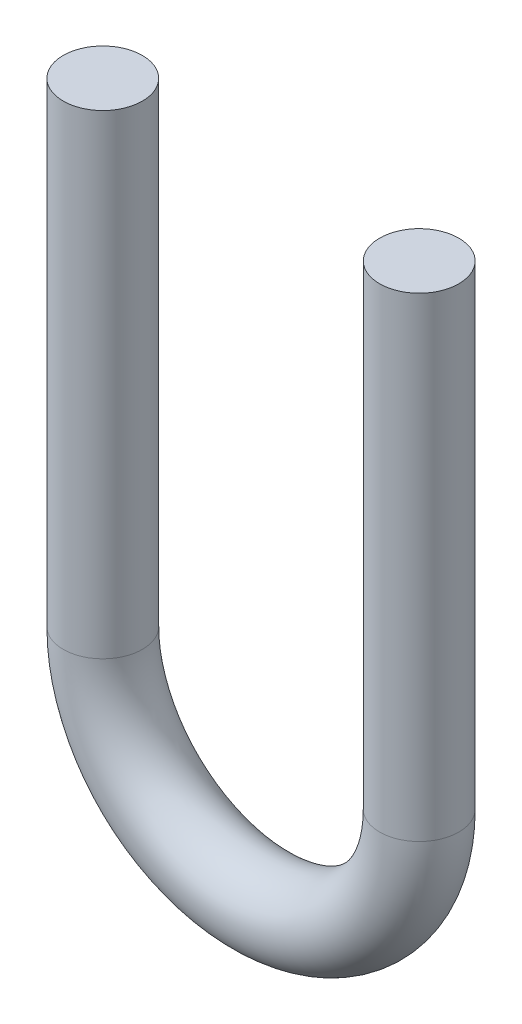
from build123d import *

# Parameters (mm, degrees)
SKETCH2_R = 0.79375


with BuildPart() as part:
    # Sweep1: sweep along a curve in space
    with BuildLine() as sweep1_path:
        Line((-32.446653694, 0.273142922, 0), (-32.446653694, -9.251857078, 0))
        ThreePointArc((-32.446653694, -9.251857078, 0), (-29.271653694, -12.426857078, 0), (-26.096653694, -9.251857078, 0))
        Line((-26.096653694, -9.251857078, 0), (-26.096653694, 0.273142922, 0))
    # Sketch2 → Sweep1 (sweep)
    with BuildSketch(Plane(origin=(-32.446653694, 0.273142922, 0), x_dir=(1, 0, 0), z_dir=(0, -1, 0))):
        with Locations((0.001300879, 0)):
            Circle(SKETCH2_R)
    sweep(path=sweep1_path.line)


solid = part.part
